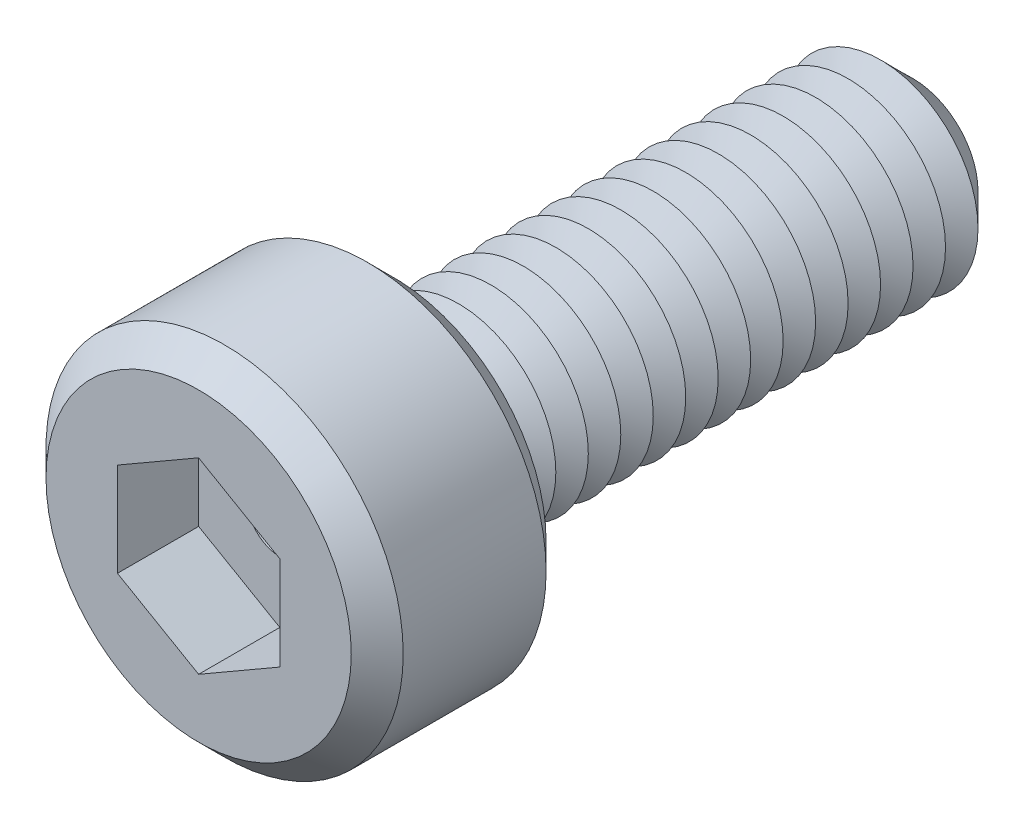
from build123d import *

# Parameters (mm, degrees)
SKETCH1_R           = 2.75
BOSS_EXTRUDE1_DEPTH = 3
SKETCH2_R           = 1.5
BOSS_EXTRUDE2_DEPTH = 8
CHAMFER1_SIZE       = 0.5
LPATTERN1_COUNT     = 15
LPATTERN1_PITCH     = 0.5
CUT_EXTRUDE1_DEPTH  = 1.25
SKETCH6_R           = 0.5
CUT_EXTRUDE2_DEPTH  = 9.75
CHAMFER2_SIZE       = 0.4


with BuildPart() as part:
    # Sketch1 → Boss-Extrude1 (new body)
    with BuildSketch(Plane.XY):
        Circle(SKETCH1_R)
    extrude(amount=BOSS_EXTRUDE1_DEPTH)

    # Sketch2 → Boss-Extrude2 (add)
    with BuildSketch(Plane(origin=(0, 0, 0), x_dir=(-1, 0, 0), z_dir=(0, 0, -1))):
        Circle(SKETCH2_R)
    extrude(amount=BOSS_EXTRUDE2_DEPTH)

    # Chamfer1
    chamfer1_edges = [part.edges().sort_by_distance(p)[0] for p in [
        (1.5, 0, -8),
    ]]
    chamfer(chamfer1_edges, length=CHAMFER1_SIZE)

    # Sketch4 → Cut-Revolve1 (revolve, cut)
    with BuildSketch(Plane(origin=(0, 0, 0), x_dir=(0, 0, -1), z_dir=(1, 0, 0)), mode=Mode.PRIVATE) as cut_revolve1_sk:
        Polygon((0, 1.5), (0.25, 1.066987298), (0.5, 1.5), align=None)
    cut_revolve1 = revolve(cut_revolve1_sk.sketch.rotate(Axis((0, 0, 2.512122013), (0, 0, -1)), 90), axis=Axis((0, 0, 2.512122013), (0, 0, -1)), mode=Mode.SUBTRACT)

    # LPattern1: Cut-Revolve1 ×15
    with Locations(*[(0, 0, -i * LPATTERN1_PITCH) for i in range(1, LPATTERN1_COUNT)]):
        add(cut_revolve1, mode=Mode.SUBTRACT)

    # Sketch5 → Cut-Extrude1 (cut)
    with BuildSketch(Plane.XY.offset(3)):
        Polygon((0, 1.443375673), (-1.25, 0.721687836), (-1.25, -0.721687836), (0, -1.443375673), (1.25, -0.721687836), (1.25, 0.721687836), align=None)
    extrude(amount=-CUT_EXTRUDE1_DEPTH, mode=Mode.SUBTRACT)

    # Sketch6 → Cut-Extrude2 (cut)
    with BuildSketch(Plane.XY.offset(1.75)):
        Circle(SKETCH6_R)
    extrude(amount=-CUT_EXTRUDE2_DEPTH, mode=Mode.SUBTRACT)

    # Chamfer2
    chamfer2_edges = [part.edges().sort_by_distance(p)[0] for p in [
        (-2.75, 0, 0),
        (-2.75, 0, 3),
    ]]
    chamfer(chamfer2_edges, length=CHAMFER2_SIZE)


solid = part.part
